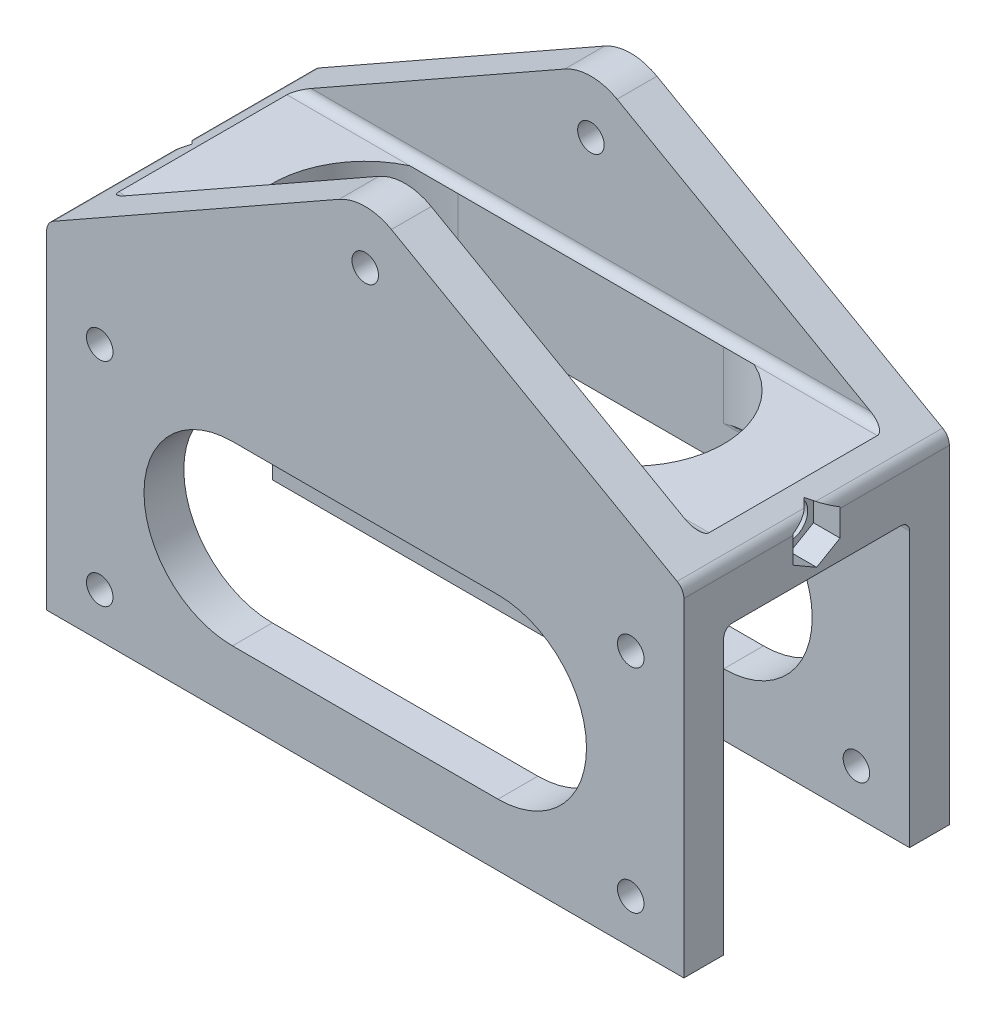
from build123d import *

# Parameters (mm, degrees)
ESQUISSE1_R                  = 3
BOSS_EXTRU_1_DEPTH           = 30
ENL_V_MAT_EXTRU_1_DEPTH      = 113.449988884
ENL_V_MAT_EXTRU_1_DEPTH_BACK = 113.449988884
ESQUISSE2_R                  = 4
ESQUISSE2_W                  = 42
ESQUISSE2_H                  = 72
CONG_1_R                     = 2
ENL_V_MAT_EXTRU_2_DEPTH      = 3.1
ENL_V_MAT_EXTRU_3_DEPTH      = 6
ENL_V_MAT_EXTRU_4_DEPTH      = 112.018016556


with BuildPart() as part:
    # Esquisse1 → Boss.-Extru.1 (new, symmetric)
    with BuildSketch(Plane.XY):
        with BuildLine():
            Line((-70.478821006, 42.861834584), (-5.915284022, 79.440757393))
            ThreePointArc((-5.915284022, 79.440757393), (0, 81), (5.915284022, 79.440757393))
            Line((5.915284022, 79.440757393), (70.478821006, 42.861834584))
            ThreePointArc((70.478821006, 42.861834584), (71.591955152, 41.762197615), (72, 40.251645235))
            Line((72, 40.251645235), (72, -34))
            Line((72, -34), (-72, -34))
            Line((-72, -34), (-72, 40.251645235))
            ThreePointArc((-72, 40.251645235), (-71.591955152, 41.762197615), (-70.478821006, 42.861834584))
        make_face()
        with Locations((-60, -24)):
            Circle(ESQUISSE1_R, mode=Mode.SUBTRACT)
        with Locations((60, -24)):
            Circle(ESQUISSE1_R, mode=Mode.SUBTRACT)
        with Locations((60, 24)):
            Circle(ESQUISSE1_R, mode=Mode.SUBTRACT)
        with Locations((-60, 24)):
            Circle(ESQUISSE1_R, mode=Mode.SUBTRACT)
        with Locations((0, 69)):
            Circle(ESQUISSE1_R, mode=Mode.SUBTRACT)
        with BuildLine():
            Line((30, -20), (-30, -20))
            ThreePointArc((-30, -20), (-50, 0), (-30, 20))
            Line((-30, 20), (30, 20))
            ThreePointArc((30, 20), (50, 0), (30, -20))
        make_face(mode=Mode.SUBTRACT)
    extrude(amount=BOSS_EXTRU_1_DEPTH, both=True)

    # Esquisse2 → Enl_v. mat.-Extru.1 (cut, two sides: drawn at the far end of the back side and taken through both)
    with BuildSketch(Plane(origin=(0, 0, 0), x_dir=(0, 0, -1), z_dir=(1, 0, 0)).offset(-ENL_V_MAT_EXTRU_1_DEPTH_BACK)):
        with Locations(Location((0, 37.5, 0), (0, 0, 43.464997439))):
            Circle(ESQUISSE2_R)
        with Locations((0, 81)):
            Rectangle(ESQUISSE2_W, ESQUISSE2_H)
        with Locations((0, -6)):
            Rectangle(ESQUISSE2_W, ESQUISSE2_H)
    extrude(amount=ENL_V_MAT_EXTRU_1_DEPTH + ENL_V_MAT_EXTRU_1_DEPTH_BACK, mode=Mode.SUBTRACT)

    # Cong_1
    cong_1_edges = [part.edges().sort_by_distance(p)[0] for p in [
        (0, 45, -21),
        (0, 45, 21),
        (0, 30, -21),
        (0, 30, 21),
    ]]
    fillet(cong_1_edges, radius=CONG_1_R)

    # Esquisse3 → Enl_v. mat.-Extru.2 (cut, symmetric)
    with BuildSketch(Plane(origin=(0, 0, 0), x_dir=(0, 0, -1), z_dir=(1, 0, 0))):
        Polygon((-5.3, 40.559956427), (-5.3, 53.379372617), (5.3, 53.379372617), (5.3, 40.559956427), (5.3, 34.440043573), (0, 31.380087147), (-5.3, 34.440043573), align=None)
    extrude(amount=ENL_V_MAT_EXTRU_2_DEPTH, both=True, mode=Mode.SUBTRACT)

    # Esquisse4 → Enl_v. mat.-Extru.3 (cut)
    with BuildSketch(Plane.ZY.offset(72)):
        Polygon((0, 43.619912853), (-5.3, 40.559956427), (-5.3, 34.440043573), (0, 31.380087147), (5.3, 34.440043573), (5.3, 40.559956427), align=None)
    enl_v_mat_extru_3 = extrude(amount=-ENL_V_MAT_EXTRU_3_DEPTH, mode=Mode.SUBTRACT)

    # Sym_trie1: Enl_v. mat.-Extru.3 across plane
    add(enl_v_mat_extru_3.mirror(Plane(origin=(0, 0, 0), x_dir=(0, 0, 1), z_dir=(1, 0, 0))), mode=Mode.SUBTRACT)

    # Esquisse5 → Enl_v. mat.-Extru.4 (cut, through all)
    with BuildSketch(Plane(origin=(0, 45, 0), x_dir=(1, 0, 0), z_dir=(0, 1, 0))):
        with BuildLine():
            Line((30, -21), (-30, -21))
            ThreePointArc((-30, -21), (-51, 0), (-30, 21))
            Line((-30, 21), (30, 21))
            ThreePointArc((30, 21), (51, 0), (30, -21))
        make_face()
    extrude(amount=-ENL_V_MAT_EXTRU_4_DEPTH, mode=Mode.SUBTRACT)


solid = part.part
